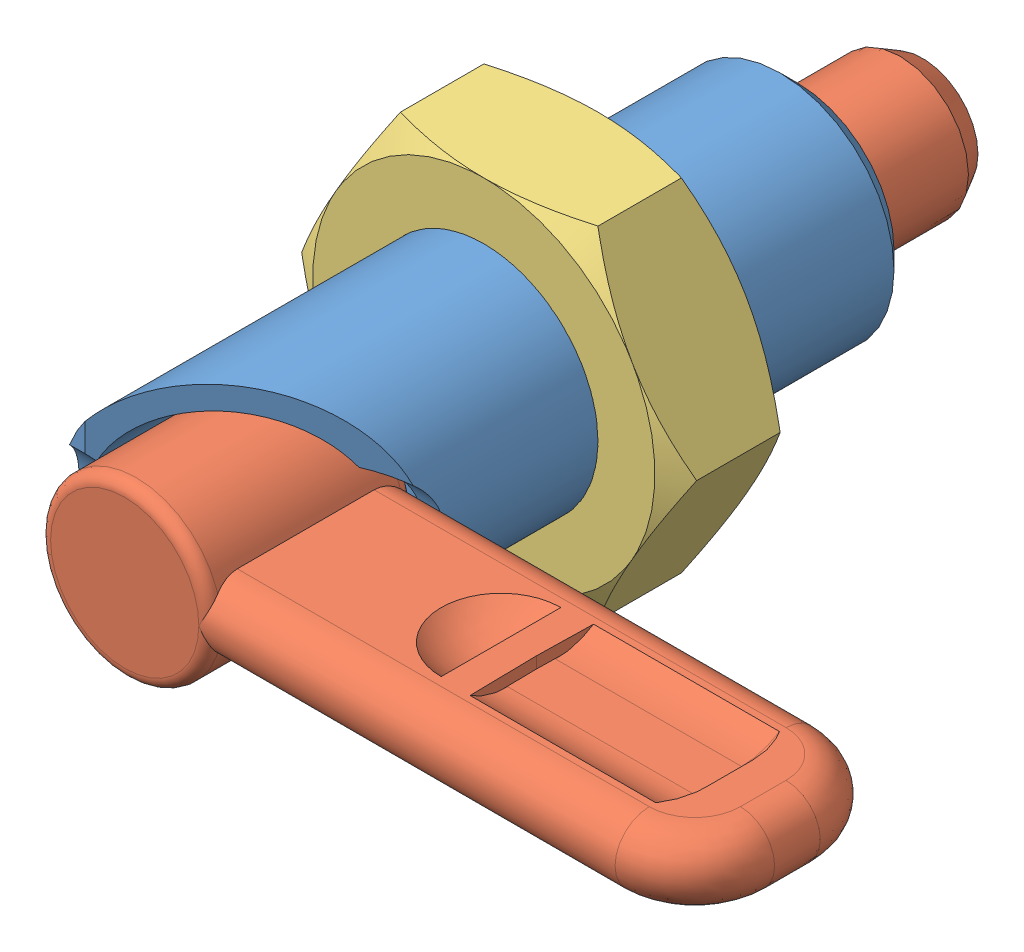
SolidWorks assembly GDX20LW-12N.sldasm, configuration Default (file format 15000). Lengths in mm.
Overall size (70.5 40.99 71).
3 component instances, 3 part files, 0 mates.
Components (placement in the parent):
- GDX20LW-12N_01-1: GDX20LW-12N_01.SLDPRT [ﾃﾞﾌｫﾙﾄ] x (1 0 0) z (0 -1 0) size (20.02 57.18 20.01)
- GDX20LW-12N_02-1: GDX20LW-12N_02.SLDPRT [ﾃﾞﾌｫﾙﾄ] x (1 0 0) z (0 -1 0) size (57.5 71 15)
- GDX20LW-12N_03-1: GDX20LW-12N_03.SLDPRT [ﾃﾞﾌｫﾙﾄ] at (0 0 17.5) x (0 0 1) z (0 1 0) size (10.01 40.99 40.99)
